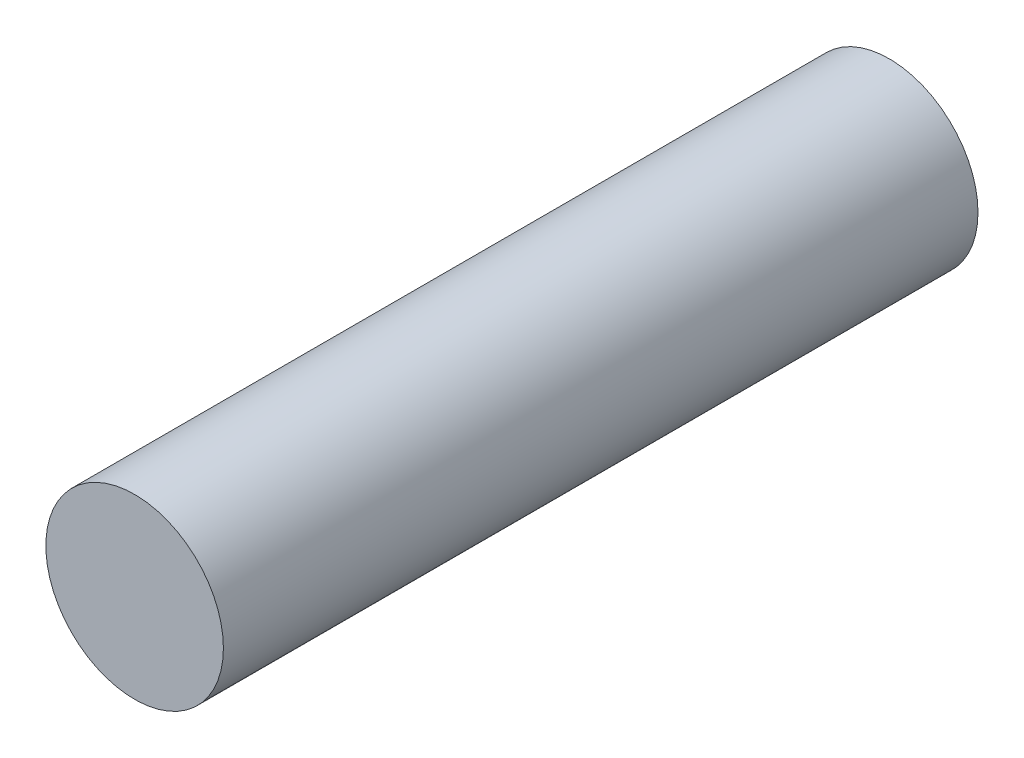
from build123d import *

# Parameters (mm, degrees)
SKETCH2_R           = 10.16
BOSS_EXTRUDE1_DEPTH = 86.36


with BuildPart() as part:
    # Sketch2 → Boss-Extrude1 (new body)
    with BuildSketch(Plane.XY):
        Circle(SKETCH2_R)
    extrude(amount=BOSS_EXTRUDE1_DEPTH)


solid = part.part
